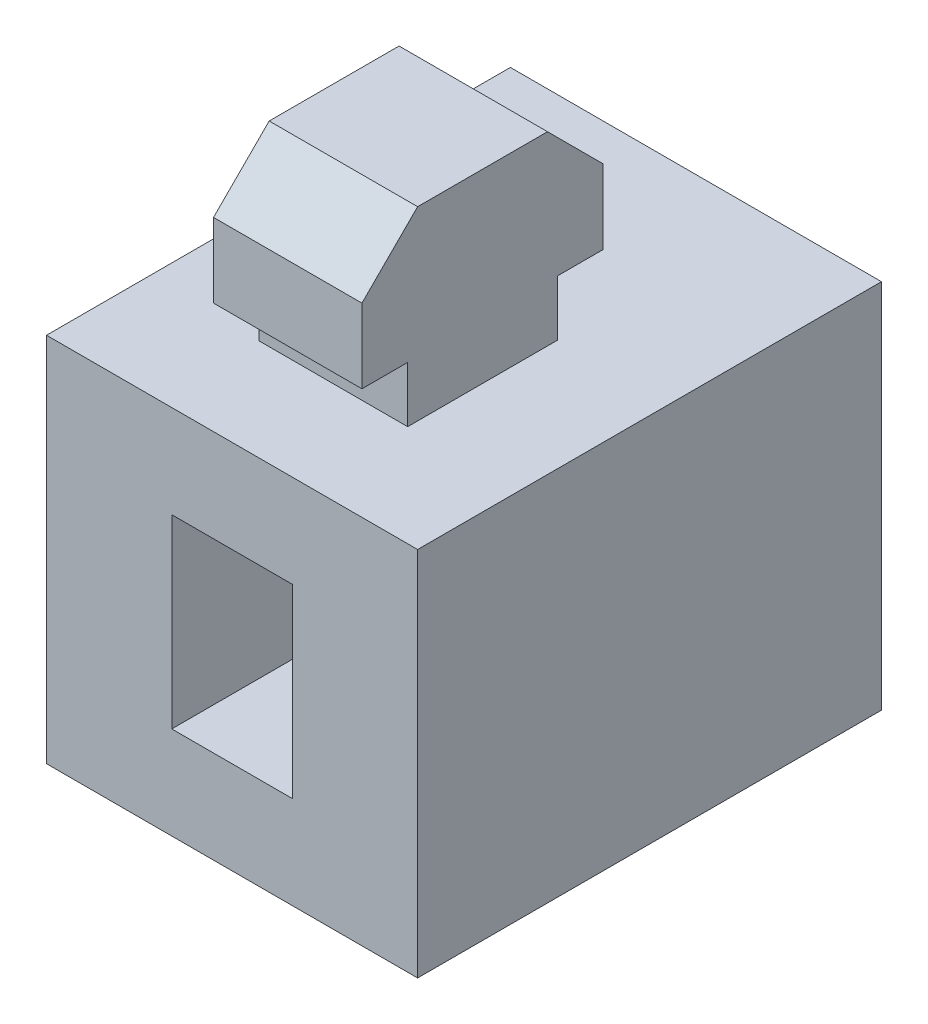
from build123d import *

# Parameters (mm, degrees)
SKETCH_1_W          = 20
SKETCH_1_H          = 20
SKETCH_1_W_2        = 6.5
SKETCH_1_H_2        = 10
EXTRUDE_1_DEPTH     = 12.5
SKETCH_2_W          = 10
SKETCH_2_H          = 5
CUT_EXTRUDE_1_DEPTH = 17
SKETCH_4_W          = 8
SKETCH_4_H          = 13
EXTRUDE_2_DEPTH     = 10
SKETCH_5_W          = 2.5
SKETCH_5_H          = 3
CUT_EXTRUDE_2_DEPTH = 28.427176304
CUT_EXTRUDE_3_DEPTH = 28.427176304


with BuildPart() as part:
    # Sketch 1 → Extrude 1 (new, symmetric)
    with BuildSketch(Plane.XY):
        Rectangle(SKETCH_1_W, SKETCH_1_H)
        Rectangle(SKETCH_1_W_2, SKETCH_1_H_2, mode=Mode.SUBTRACT)
    extrude(amount=EXTRUDE_1_DEPTH, both=True)

    # Sketch 2 → Cut-Extrude 1 (cut)
    with BuildSketch(Plane.XZ.offset(10)):
        with Locations((0, 3)):
            Rectangle(SKETCH_2_W, SKETCH_2_H)
    extrude(amount=-CUT_EXTRUDE_1_DEPTH, mode=Mode.SUBTRACT)

    # Sketch 4 → Extrude 2 (add)
    with BuildSketch(Plane(origin=(0, 10, 0), x_dir=(1, 0, 0), z_dir=(0, 1, 0))):
        with Locations((0, -3)):
            Rectangle(SKETCH_4_W, SKETCH_4_H)
    extrude(amount=EXTRUDE_2_DEPTH)

    # Sketch 5 → Cut-Extrude 2 (cut, through all)
    with BuildSketch(Plane(origin=(4, 0, 0), x_dir=(0, 0, -1), z_dir=(1, 0, 0))):
        with Locations((2.285888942, 11.5)):
            Rectangle(SKETCH_5_W, SKETCH_5_H)
    cut_extrude_2 = extrude(amount=-CUT_EXTRUDE_2_DEPTH, mode=Mode.SUBTRACT)

    # Mirror 1: Cut-Extrude 2 across plane
    add(cut_extrude_2.mirror(Plane.XY.offset(3)), mode=Mode.SUBTRACT)

    # Sketch 6 → Cut-Extrude 3 (cut, through all)
    with BuildSketch(Plane(origin=(4, 0, 0), x_dir=(0, 0, -1), z_dir=(1, 0, 0))):
        Polygon((3.5, 17), (3.5, 20), (0.5, 20), align=None)
    cut_extrude_3 = extrude(amount=-CUT_EXTRUDE_3_DEPTH, mode=Mode.SUBTRACT)

    # Mirror 2: Cut-Extrude 3 across plane
    add(cut_extrude_3.mirror(Plane.XY.offset(3)), mode=Mode.SUBTRACT)


solid = part.part
